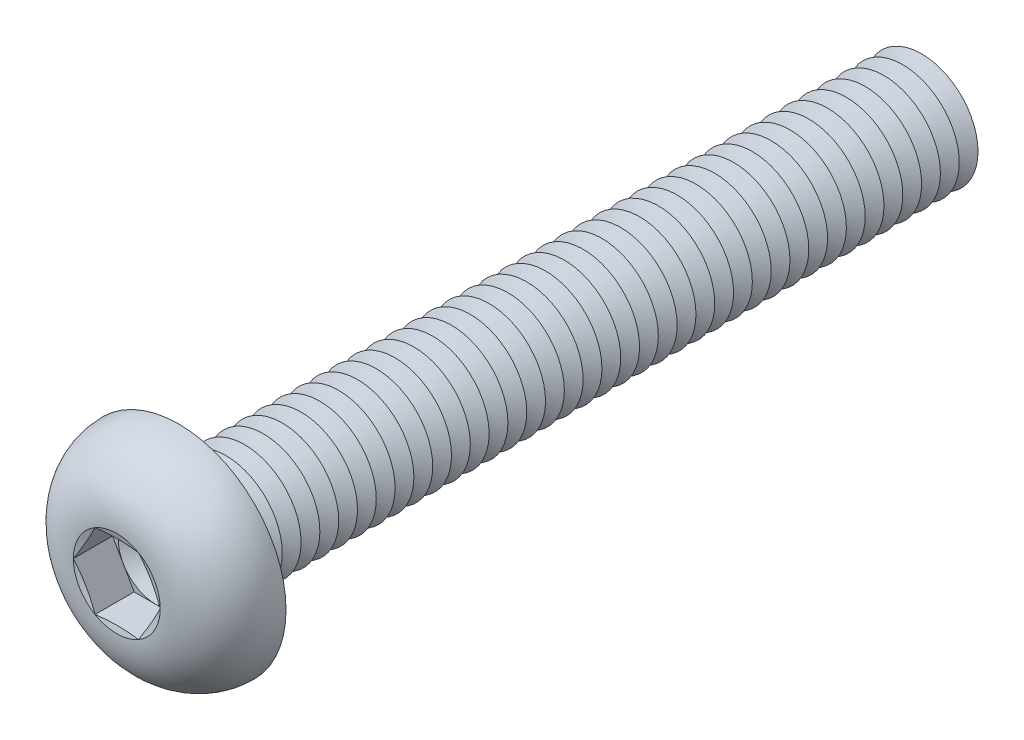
from build123d import *

# Parameters (mm, degrees)
FILLET1_R          = 0.25
LPATTERN1_COUNT    = 40
LPATTERN1_PITCH    = 0.5
CUT_EXTRUDE1_DEPTH = 1.04


with BuildPart() as part:
    # Sketch1 → Revolve1 (revolve)
    with BuildSketch(Plane(origin=(0, 0, 0), x_dir=(0, 0, -1), z_dir=(1, 0, 0)), mode=Mode.PRIVATE) as revolve1_sk:
        with BuildLine():
            Line((0, 1.5), (0, 2.85))
            ThreePointArc((0, 2.85), (-1.182850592, 2.35063849), (-1.65, 1.1547))
            Line((-1.65, 1.1547), (-1.495299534, 0.57735))
            Line((-1.495299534, 0.57735), (-1.65, 0.57735))
            Line((-1.65, 0.57735), (-1.65, 0))
            Line((-1.65, 0), (20, 0))
            Line((20, 0), (20, 1.5))
            Line((20, 1.5), (0, 1.5))
        make_face()
    revolve(revolve1_sk.sketch.rotate(Axis((0, 0, -20), (0, 0, 1)), 90), axis=Axis((0, 0, -20), (0, 0, 1)))

    # Fillet1
    fillet1_edges = [part.edges().sort_by_distance(p)[0] for p in [
        (1.5, 0, 0),
    ]]
    fillet(fillet1_edges, radius=FILLET1_R)

    # Sketch2 → Cut-Revolve1 (revolve, cut)
    with BuildSketch(Plane(origin=(0, 0, 0), x_dir=(0, 0, -1), z_dir=(1, 0, 0)), mode=Mode.PRIVATE) as cut_revolve1_sk:
        Polygon((19.75, 1.5), (20.25, 1.5), (20, 1.066987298), align=None)
    cut_revolve1 = revolve(cut_revolve1_sk.sketch.rotate(Axis((0, 0, -20), (0, 0, -1)), 270), axis=Axis((0, 0, -20), (0, 0, -1)), mode=Mode.SUBTRACT)

    # LPattern1: Cut-Revolve1 ×40
    with Locations(*[(0, 0, i * LPATTERN1_PITCH) for i in range(1, LPATTERN1_COUNT)]):
        add(cut_revolve1, mode=Mode.SUBTRACT)

    # Sketch3 → Cut-Extrude1 (cut)
    with BuildSketch(Plane.XY.offset(1.65)):
        Polygon((0.57735, 0.999999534), (-0.57735, 0.999999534), (-1.1547, 0), (-0.57735, -0.999999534), (0.57735, -0.999999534), (1.1547, 0), align=None)
    extrude(amount=-CUT_EXTRUDE1_DEPTH, mode=Mode.SUBTRACT)

    # Cut-Extrude2 cone 1 section (on through the dimple's axis) → Cut-Extrude2 (revolve, cut)
    with BuildSketch(Plane(origin=(0, 0, 0.61), x_dir=(0, -1, 0), z_dir=(1, 0, 0))):
        Polygon((0, 0), (0.999999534, 0), (0, 0.57735), align=None)
    revolve(axis=Axis((0, 0, 0.61), (0, 0, -1)), mode=Mode.SUBTRACT)


solid = part.part
